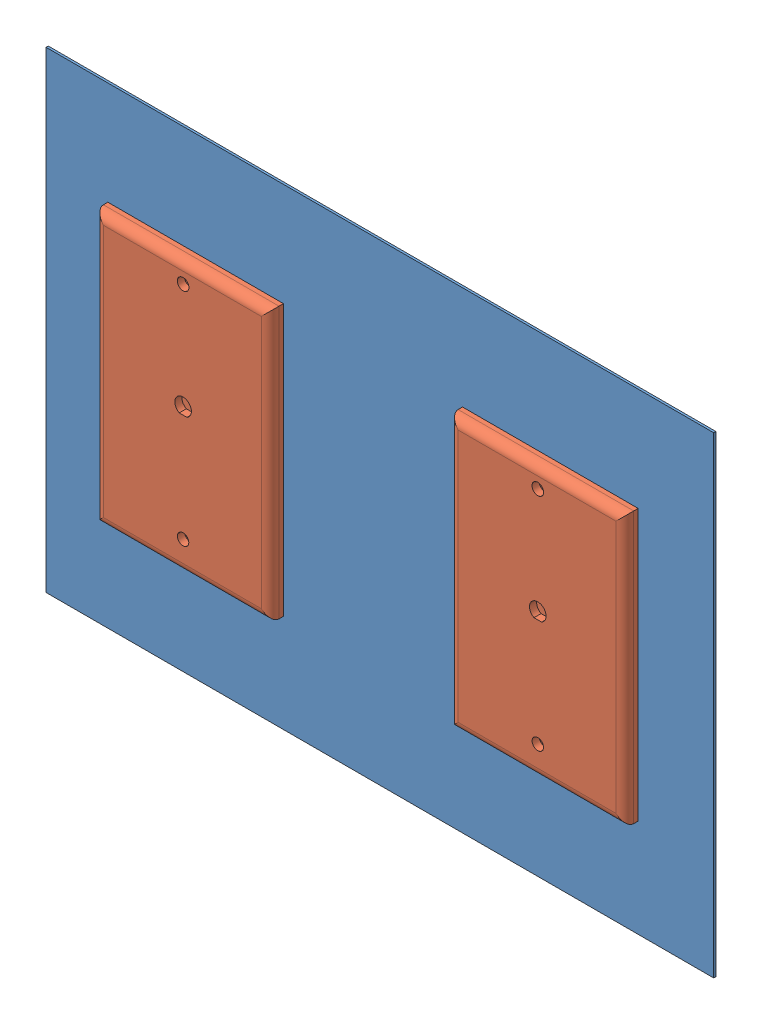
SolidWorks assembly WallPlates-NoValves.SLDASM, configuration Default (file format 3400). Lengths in mm.
Overall size (764.99 541.02 17.78).
3 component instances, 2 part files, 6 mates.
Components (placement in the parent):
- Panel-1: Panel.SLDPRT [Default] at origin size (764.99 541.02 2.54)
- WallPlate-1: WallPlate.SLDPRT [Default] at (298.6521 23.6153 2.54) size (201.23 310.31 15.24)
- WallPlate-2: WallPlate.SLDPRT [Default] at (-107.7479 23.6153 2.54) size (201.23 310.31 15.24)
Mates (geometry in assembly coordinates):
- Coincident1: coincident anti-aligned: plane of Panel-1 through (-292.9346 -795.6374 2.54) normal (0 0 1); plane of WallPlate-1 through (184.223 -142.2564 2.54) normal (0 0 -1)
- Concentric2: concentric aligned: cylinder of Panel-1; cylinder of WallPlate-2
- Coincident2: coincident anti-aligned: plane of Panel-1 through (-292.9346 -795.6374 2.54) normal (0 0 1); plane of WallPlate-2 through (-222.177 -142.2564 2.54) normal (0 0 -1)
- Concentric5: concentric aligned: circle of Panel-1; circle of WallPlate-2
- Concentric9: concentric aligned: cylinder of Panel-1; cylinder of WallPlate-1
- Concentric14: concentric aligned: circle of Panel-1; circle of WallPlate-1
